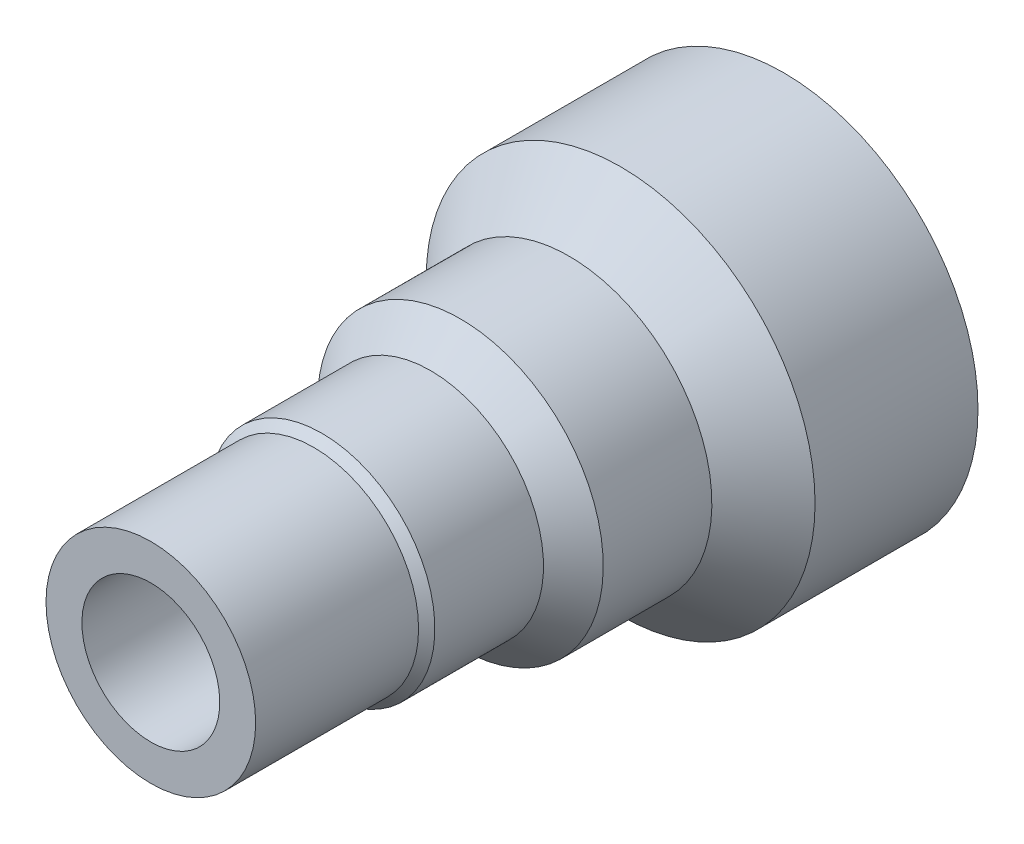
ISO-10303-21;
HEADER;
FILE_DESCRIPTION(('STEP AP214'),'2;1');
FILE_NAME('part.step','',(''),(''),'','','');
FILE_SCHEMA(('AUTOMOTIVE_DESIGN { 1 0 10303 214 1 1 1 1 }'));
ENDSEC;
DATA;
#1=APPLICATION_CONTEXT('core data for automotive mechanical design processes');
#2=APPLICATION_PROTOCOL_DEFINITION('international standard','automotive_design',2000,#1);
#3=PRODUCT_CONTEXT('',#1,'mechanical');
#4=PRODUCT('Part','Part','',(#3));
#5=PRODUCT_RELATED_PRODUCT_CATEGORY('part','',(#4));
#6=PRODUCT_DEFINITION_FORMATION('','',#4);
#7=PRODUCT_DEFINITION_CONTEXT('part definition',#1,'design');
#8=PRODUCT_DEFINITION('design','',#6,#7);
#9=PRODUCT_DEFINITION_SHAPE('','',#8);
#10=(LENGTH_UNIT() NAMED_UNIT(*) SI_UNIT(.MILLI.,.METRE.));
#11=(NAMED_UNIT(*) PLANE_ANGLE_UNIT() SI_UNIT($,.RADIAN.));
#12=(NAMED_UNIT(*) SI_UNIT($,.STERADIAN.) SOLID_ANGLE_UNIT());
#13=UNCERTAINTY_MEASURE_WITH_UNIT(LENGTH_MEASURE(1.E-05),#10,'distance_accuracy_value','');
#14=(GEOMETRIC_REPRESENTATION_CONTEXT(3) GLOBAL_UNCERTAINTY_ASSIGNED_CONTEXT((#13)) GLOBAL_UNIT_ASSIGNED_CONTEXT((#10,
#11,#12)) REPRESENTATION_CONTEXT('',''));
#15=CARTESIAN_POINT('',(0.,0.,0.));
#16=DIRECTION('',(0.,0.,1.));
#17=DIRECTION('',(1.,0.,0.));
#18=AXIS2_PLACEMENT_3D('',#15,#16,#17);
#19=CARTESIAN_POINT('',(0.,0.,39.2951591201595));
#20=DIRECTION('',(0.,0.,1.));
#21=DIRECTION('',(0.,-1.,0.));
#22=AXIS2_PLACEMENT_3D('',#19,#20,#21);
#23=CYLINDRICAL_SURFACE('',#22,17.9);
#24=CARTESIAN_POINT('',(0.,0.,-7.23758084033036));
#25=DIRECTION('',(0.,0.,1.));
#26=DIRECTION('',(0.,-1.,0.));
#27=AXIS2_PLACEMENT_3D('',#24,#25,#26);
#28=CIRCLE('',#27,17.9);
#29=CARTESIAN_POINT('',(0.,-17.9,-7.23758084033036));
#30=VERTEX_POINT('',#29);
#31=EDGE_CURVE('E10',#30,#30,#28,.T.);
#32=ORIENTED_EDGE('',*,*,#31,.F.);
#33=EDGE_LOOP('',(#32));
#34=FACE_BOUND('',#33,.T.);
#35=CARTESIAN_POINT('',(0.,0.,-22.2375808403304));
#36=DIRECTION('',(0.,0.,1.));
#37=DIRECTION('',(0.,-1.,0.));
#38=AXIS2_PLACEMENT_3D('',#35,#36,#37);
#39=CIRCLE('',#38,17.9);
#40=CARTESIAN_POINT('',(0.,-17.9,-22.2375808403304));
#41=VERTEX_POINT('',#40);
#42=EDGE_CURVE('E88',#41,#41,#39,.T.);
#43=ORIENTED_EDGE('',*,*,#42,.T.);
#44=EDGE_LOOP('',(#43));
#45=FACE_BOUND('',#44,.T.);
#46=ADVANCED_FACE('F37',(#34,#45),#23,.T.);
#47=CARTESIAN_POINT('',(0.,0.,-7.23758084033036));
#48=DIRECTION('',(0.,0.,-1.));
#49=DIRECTION('',(0.,1.,0.));
#50=AXIS2_PLACEMENT_3D('',#47,#48,#49);
#51=CONICAL_SURFACE('',#50,17.9,0.785398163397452);
#52=CARTESIAN_POINT('',(0.,0.,-2.4875808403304));
#53=DIRECTION('',(0.,0.,1.));
#54=DIRECTION('',(0.,-1.,0.));
#55=AXIS2_PLACEMENT_3D('',#52,#53,#54);
#56=CIRCLE('',#55,13.15);
#57=CARTESIAN_POINT('',(0.,-13.15,-2.4875808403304));
#58=VERTEX_POINT('',#57);
#59=EDGE_CURVE('E44',#58,#58,#56,.T.);
#60=ORIENTED_EDGE('',*,*,#59,.F.);
#61=EDGE_LOOP('',(#60));
#62=FACE_BOUND('',#61,.T.);
#63=ORIENTED_EDGE('',*,*,#31,.T.);
#64=EDGE_LOOP('',(#63));
#65=FACE_BOUND('',#64,.T.);
#66=ADVANCED_FACE('F150',(#62,#65),#51,.T.);
#67=CARTESIAN_POINT('',(0.,0.,39.2951591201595));
#68=DIRECTION('',(0.,0.,1.));
#69=DIRECTION('',(0.,-1.,0.));
#70=AXIS2_PLACEMENT_3D('',#67,#68,#69);
#71=CYLINDRICAL_SURFACE('',#70,13.15);
#72=CARTESIAN_POINT('',(0.,0.,7.5124191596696));
#73=DIRECTION('',(0.,0.,1.));
#74=DIRECTION('',(0.,-1.,0.));
#75=AXIS2_PLACEMENT_3D('',#72,#73,#74);
#76=CIRCLE('',#75,13.15);
#77=CARTESIAN_POINT('',(0.,-13.15,7.51241915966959));
#78=VERTEX_POINT('',#77);
#79=EDGE_CURVE('E49',#78,#78,#76,.T.);
#80=ORIENTED_EDGE('',*,*,#79,.F.);
#81=EDGE_LOOP('',(#80));
#82=FACE_BOUND('',#81,.T.);
#83=ORIENTED_EDGE('',*,*,#59,.T.);
#84=EDGE_LOOP('',(#83));
#85=FACE_BOUND('',#84,.T.);
#86=ADVANCED_FACE('F145',(#82,#85),#71,.T.);
#87=CARTESIAN_POINT('',(0.,0.,7.5124191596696));
#88=DIRECTION('',(0.,0.,-1.));
#89=DIRECTION('',(0.,1.,0.));
#90=AXIS2_PLACEMENT_3D('',#87,#88,#89);
#91=CONICAL_SURFACE('',#90,13.15,0.785398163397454);
#92=CARTESIAN_POINT('',(0.,0.,10.2624191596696));
#93=DIRECTION('',(0.,0.,1.));
#94=DIRECTION('',(0.,-1.,0.));
#95=AXIS2_PLACEMENT_3D('',#92,#93,#94);
#96=CIRCLE('',#95,10.4);
#97=CARTESIAN_POINT('',(0.,-10.4,10.2624191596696));
#98=VERTEX_POINT('',#97);
#99=EDGE_CURVE('E54',#98,#98,#96,.T.);
#100=ORIENTED_EDGE('',*,*,#99,.F.);
#101=EDGE_LOOP('',(#100));
#102=FACE_BOUND('',#101,.T.);
#103=ORIENTED_EDGE('',*,*,#79,.T.);
#104=EDGE_LOOP('',(#103));
#105=FACE_BOUND('',#104,.T.);
#106=ADVANCED_FACE('F139',(#102,#105),#91,.T.);
#107=CARTESIAN_POINT('',(0.,0.,39.2951591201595));
#108=DIRECTION('',(0.,0.,1.));
#109=DIRECTION('',(0.,-1.,0.));
#110=AXIS2_PLACEMENT_3D('',#107,#108,#109);
#111=CYLINDRICAL_SURFACE('',#110,10.4);
#112=CARTESIAN_POINT('',(0.,0.,20.2624191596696));
#113=DIRECTION('',(0.,0.,1.));
#114=DIRECTION('',(0.,-1.,0.));
#115=AXIS2_PLACEMENT_3D('',#112,#113,#114);
#116=CIRCLE('',#115,10.4);
#117=CARTESIAN_POINT('',(0.,-10.4,20.2624191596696));
#118=VERTEX_POINT('',#117);
#119=EDGE_CURVE('E60',#118,#118,#116,.T.);
#120=ORIENTED_EDGE('',*,*,#119,.F.);
#121=EDGE_LOOP('',(#120));
#122=FACE_BOUND('',#121,.T.);
#123=ORIENTED_EDGE('',*,*,#99,.T.);
#124=EDGE_LOOP('',(#123));
#125=FACE_BOUND('',#124,.T.);
#126=ADVANCED_FACE('F133',(#122,#125),#111,.T.);
#127=CARTESIAN_POINT('',(0.,0.,20.2624191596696));
#128=DIRECTION('',(0.,0.,-1.));
#129=DIRECTION('',(0.,1.,0.));
#130=AXIS2_PLACEMENT_3D('',#127,#128,#129);
#131=CONICAL_SURFACE('',#130,10.4,0.785398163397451);
#132=CARTESIAN_POINT('',(0.,0.,21.0124191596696));
#133=DIRECTION('',(0.,0.,1.));
#134=DIRECTION('',(0.,-1.,0.));
#135=AXIS2_PLACEMENT_3D('',#132,#133,#134);
#136=CIRCLE('',#135,9.65);
#137=CARTESIAN_POINT('',(0.,-9.64999999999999,21.0124191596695));
#138=VERTEX_POINT('',#137);
#139=EDGE_CURVE('E64',#138,#138,#136,.T.);
#140=ORIENTED_EDGE('',*,*,#139,.F.);
#141=EDGE_LOOP('',(#140));
#142=FACE_BOUND('',#141,.T.);
#143=ORIENTED_EDGE('',*,*,#119,.T.);
#144=EDGE_LOOP('',(#143));
#145=FACE_BOUND('',#144,.T.);
#146=ADVANCED_FACE('F127',(#142,#145),#131,.T.);
#147=CARTESIAN_POINT('',(0.,0.,39.2951591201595));
#148=DIRECTION('',(0.,0.,1.));
#149=DIRECTION('',(0.,-1.,0.));
#150=AXIS2_PLACEMENT_3D('',#147,#148,#149);
#151=CYLINDRICAL_SURFACE('',#150,9.65);
#152=CARTESIAN_POINT('',(0.,0.,36.0124191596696));
#153=DIRECTION('',(0.,0.,1.));
#154=DIRECTION('',(0.,-1.,0.));
#155=AXIS2_PLACEMENT_3D('',#152,#153,#154);
#156=CIRCLE('',#155,9.65);
#157=CARTESIAN_POINT('',(0.,-9.65,36.0124191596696));
#158=VERTEX_POINT('',#157);
#159=EDGE_CURVE('E68',#158,#158,#156,.T.);
#160=ORIENTED_EDGE('',*,*,#159,.F.);
#161=EDGE_LOOP('',(#160));
#162=FACE_BOUND('',#161,.T.);
#163=ORIENTED_EDGE('',*,*,#139,.T.);
#164=EDGE_LOOP('',(#163));
#165=FACE_BOUND('',#164,.T.);
#166=ADVANCED_FACE('F121',(#162,#165),#151,.T.);
#167=CARTESIAN_POINT('',(0.,9.65,36.0124191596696));
#168=DIRECTION('',(0.,0.,-1.));
#169=DIRECTION('',(0.,1.,0.));
#170=AXIS2_PLACEMENT_3D('',#167,#168,#169);
#171=PLANE('',#170);
#172=CARTESIAN_POINT('',(0.,0.,36.0124191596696));
#173=DIRECTION('',(0.,0.,1.));
#174=DIRECTION('',(0.,-1.,0.));
#175=AXIS2_PLACEMENT_3D('',#172,#173,#174);
#176=CIRCLE('',#175,6.3464413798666);
#177=CARTESIAN_POINT('',(0.,-6.3464413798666,36.0124191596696));
#178=VERTEX_POINT('',#177);
#179=EDGE_CURVE('E72',#178,#178,#176,.T.);
#180=ORIENTED_EDGE('',*,*,#179,.F.);
#181=EDGE_LOOP('',(#180));
#182=FACE_BOUND('',#181,.T.);
#183=ORIENTED_EDGE('',*,*,#159,.T.);
#184=EDGE_LOOP('',(#183));
#185=FACE_BOUND('',#184,.T.);
#186=ADVANCED_FACE('F115',(#182,#185),#171,.F.);
#187=CARTESIAN_POINT('',(0.,0.,39.2951591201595));
#188=DIRECTION('',(0.,0.,1.));
#189=DIRECTION('',(0.,-1.,0.));
#190=AXIS2_PLACEMENT_3D('',#187,#188,#189);
#191=CYLINDRICAL_SURFACE('',#190,6.3464413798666);
#192=CARTESIAN_POINT('',(0.,0.,26.0124191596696));
#193=DIRECTION('',(0.,0.,1.));
#194=DIRECTION('',(0.,-1.,0.));
#195=AXIS2_PLACEMENT_3D('',#192,#193,#194);
#196=CIRCLE('',#195,6.3464413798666);
#197=CARTESIAN_POINT('',(0.,-6.3464413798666,26.0124191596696));
#198=VERTEX_POINT('',#197);
#199=EDGE_CURVE('E76',#198,#198,#196,.T.);
#200=ORIENTED_EDGE('',*,*,#199,.F.);
#201=EDGE_LOOP('',(#200));
#202=FACE_BOUND('',#201,.T.);
#203=ORIENTED_EDGE('',*,*,#179,.T.);
#204=EDGE_LOOP('',(#203));
#205=FACE_BOUND('',#204,.T.);
#206=ADVANCED_FACE('F109',(#202,#205),#191,.F.);
#207=CARTESIAN_POINT('',(0.,0.,26.0124191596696));
#208=DIRECTION('',(0.,0.,1.));
#209=DIRECTION('',(0.,-1.,0.));
#210=AXIS2_PLACEMENT_3D('',#207,#208,#209);
#211=CONICAL_SURFACE('',#210,6.3464413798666,0.0872664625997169);
#212=CARTESIAN_POINT('',(0.,0.,-12.2375808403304));
#213=DIRECTION('',(0.,0.,1.));
#214=DIRECTION('',(0.,-1.,0.));
#215=AXIS2_PLACEMENT_3D('',#212,#213,#214);
#216=CIRCLE('',#215,3.);
#217=CARTESIAN_POINT('',(0.,-2.99999999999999,-12.2375808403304));
#218=VERTEX_POINT('',#217);
#219=EDGE_CURVE('E80',#218,#218,#216,.T.);
#220=ORIENTED_EDGE('',*,*,#219,.F.);
#221=EDGE_LOOP('',(#220));
#222=FACE_BOUND('',#221,.T.);
#223=ORIENTED_EDGE('',*,*,#199,.T.);
#224=EDGE_LOOP('',(#223));
#225=FACE_BOUND('',#224,.T.);
#226=ADVANCED_FACE('F103',(#222,#225),#211,.F.);
#227=CARTESIAN_POINT('',(0.,0.,39.2951591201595));
#228=DIRECTION('',(0.,0.,1.));
#229=DIRECTION('',(0.,-1.,0.));
#230=AXIS2_PLACEMENT_3D('',#227,#228,#229);
#231=CYLINDRICAL_SURFACE('',#230,3.);
#232=CARTESIAN_POINT('',(0.,0.,-22.2375808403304));
#233=DIRECTION('',(0.,0.,1.));
#234=DIRECTION('',(0.,-1.,0.));
#235=AXIS2_PLACEMENT_3D('',#232,#233,#234);
#236=CIRCLE('',#235,3.);
#237=CARTESIAN_POINT('',(0.,-2.99999999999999,-22.2375808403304));
#238=VERTEX_POINT('',#237);
#239=EDGE_CURVE('E84',#238,#238,#236,.T.);
#240=ORIENTED_EDGE('',*,*,#239,.F.);
#241=EDGE_LOOP('',(#240));
#242=FACE_BOUND('',#241,.T.);
#243=ORIENTED_EDGE('',*,*,#219,.T.);
#244=EDGE_LOOP('',(#243));
#245=FACE_BOUND('',#244,.T.);
#246=ADVANCED_FACE('F97',(#242,#245),#231,.F.);
#247=CARTESIAN_POINT('',(0.,3.00000000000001,-22.2375808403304));
#248=DIRECTION('',(0.,0.,1.));
#249=DIRECTION('',(0.,-1.,0.));
#250=AXIS2_PLACEMENT_3D('',#247,#248,#249);
#251=PLANE('',#250);
#252=ORIENTED_EDGE('',*,*,#42,.F.);
#253=EDGE_LOOP('',(#252));
#254=FACE_BOUND('',#253,.T.);
#255=ORIENTED_EDGE('',*,*,#239,.T.);
#256=EDGE_LOOP('',(#255));
#257=FACE_BOUND('',#256,.T.);
#258=ADVANCED_FACE('F94',(#254,#257),#251,.F.);
#259=CLOSED_SHELL('',(#46,#66,#86,#106,#126,#146,#166,#186,#206,#226,#246,#258));
#260=MANIFOLD_SOLID_BREP('B2',#259);
#261=ADVANCED_BREP_SHAPE_REPRESENTATION('',(#18,#260),#14);
#262=SHAPE_DEFINITION_REPRESENTATION(#9,#261);
ENDSEC;
END-ISO-10303-21;
